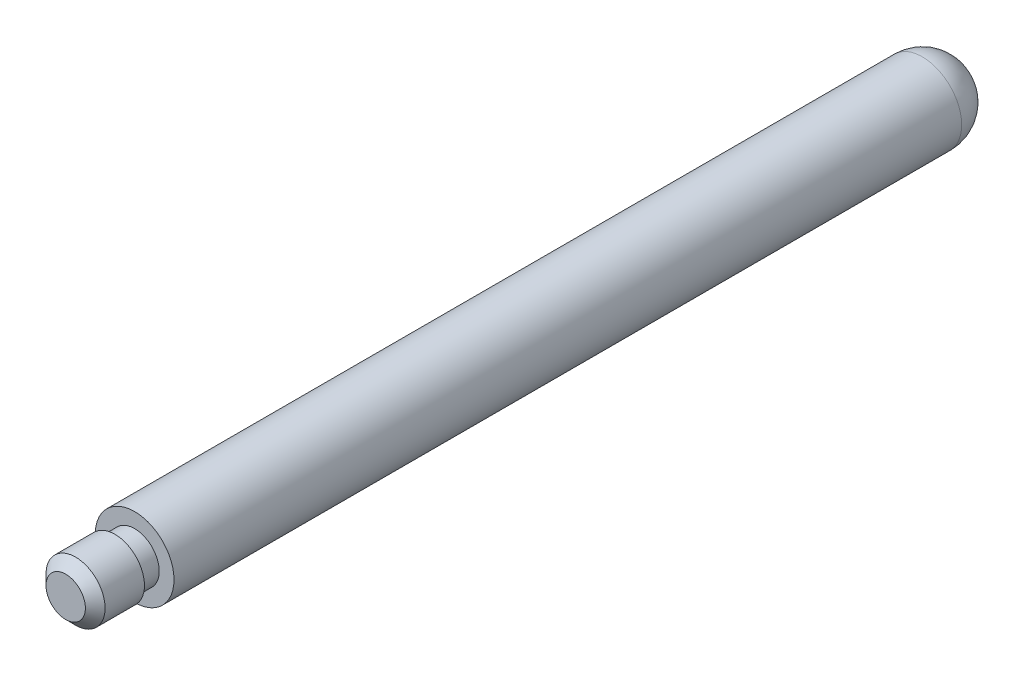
from build123d import *

# Parameters (mm, degrees)
SKETCH_1_R         = 4
EXTRUDE_1_DEPTH    = 80
SKETCH_2_R         = 2.5
EXTRUDE_2_DEPTH    = 2
SKETCH_3_R         = 3
EXTRUDE_3_DEPTH    = 5
CHAMFER_1_SIZE     = 1
DOME_1_FACE_RADIUS = 4
DOME_1_HEIGHT      = 4


with BuildPart() as part:
    # Sketch 1 → Extrude 1 (new body)
    with BuildSketch(Plane.XY):
        Circle(SKETCH_1_R)
    extrude(amount=EXTRUDE_1_DEPTH)

    # Sketch 2 → Extrude 2 (add)
    with BuildSketch(Plane.XY.offset(80)):
        Circle(SKETCH_2_R)
    extrude(amount=EXTRUDE_2_DEPTH)

    # Sketch 3 → Extrude 3 (add)
    with BuildSketch(Plane.XY.offset(82)):
        Circle(SKETCH_3_R)
    extrude(amount=EXTRUDE_3_DEPTH)

    # Chamfer 1
    chamfer_1_edges = [part.edges().sort_by_distance(p)[0] for p in [
        (-3, 0, 87),
    ]]
    chamfer(chamfer_1_edges, length=CHAMFER_1_SIZE)

    # Dome 1: a dome of height H over a round flat face of radius A is a cap of a sphere of radius (A * A + H * H) / (2 * H)
    dome_1_r = (DOME_1_FACE_RADIUS * DOME_1_FACE_RADIUS + DOME_1_HEIGHT * DOME_1_HEIGHT) / (2 * DOME_1_HEIGHT)
    dome_1_base = Plane((0, 0, 0), z_dir=(0, 0, -1))
    with Locations(dome_1_base.offset(DOME_1_HEIGHT - dome_1_r)):
        dome_1_ball = Sphere(dome_1_r, mode=Mode.PRIVATE)
    add(split(dome_1_ball, bisect_by=dome_1_base, keep=Keep.TOP, mode=Mode.PRIVATE))


solid = part.part
